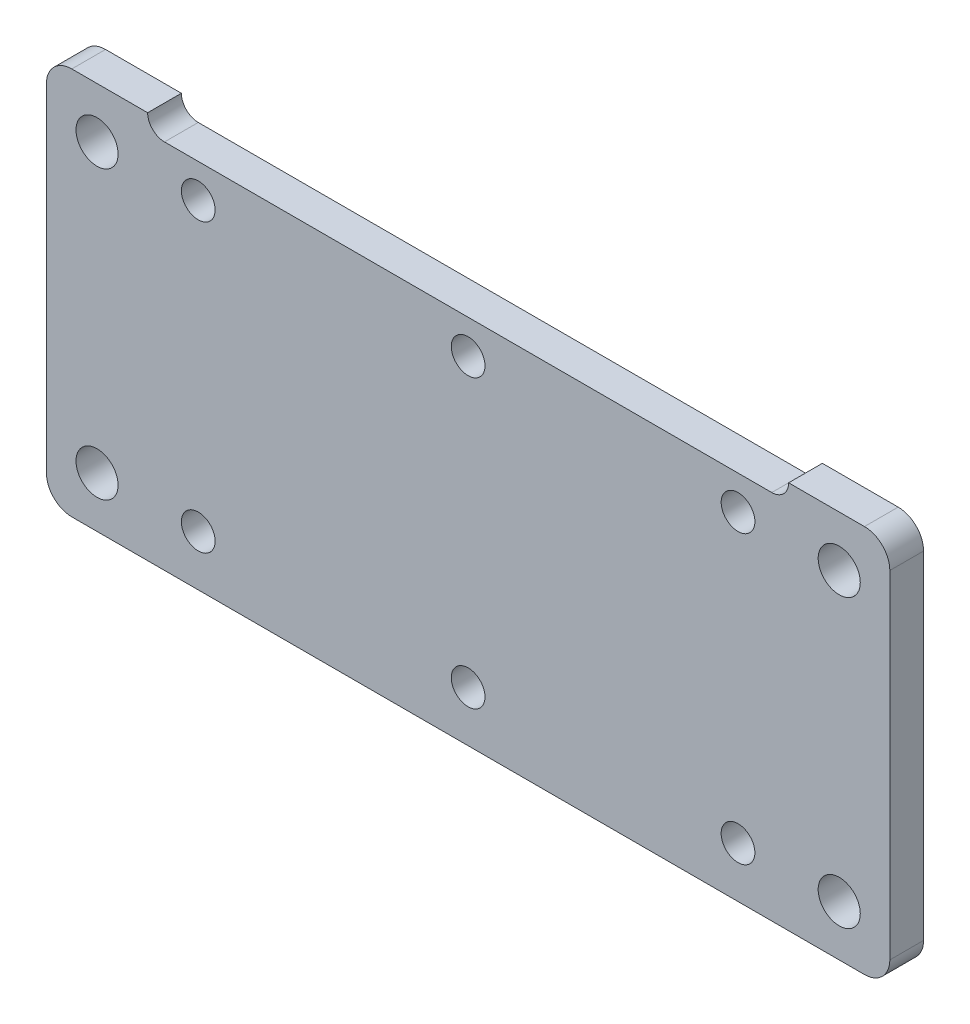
ISO-10303-21;
HEADER;
FILE_DESCRIPTION(('STEP AP214'),'2;1');
FILE_NAME('part.step','',(''),(''),'','','');
FILE_SCHEMA(('AUTOMOTIVE_DESIGN { 1 0 10303 214 1 1 1 1 }'));
ENDSEC;
DATA;
#1=APPLICATION_CONTEXT('core data for automotive mechanical design processes');
#2=APPLICATION_PROTOCOL_DEFINITION('international standard','automotive_design',2000,#1);
#3=PRODUCT_CONTEXT('',#1,'mechanical');
#4=PRODUCT('Part','Part','',(#3));
#5=PRODUCT_RELATED_PRODUCT_CATEGORY('part','',(#4));
#6=PRODUCT_DEFINITION_FORMATION('','',#4);
#7=PRODUCT_DEFINITION_CONTEXT('part definition',#1,'design');
#8=PRODUCT_DEFINITION('design','',#6,#7);
#9=PRODUCT_DEFINITION_SHAPE('','',#8);
#10=(LENGTH_UNIT() NAMED_UNIT(*) SI_UNIT(.MILLI.,.METRE.));
#11=(NAMED_UNIT(*) PLANE_ANGLE_UNIT() SI_UNIT($,.RADIAN.));
#12=(NAMED_UNIT(*) SI_UNIT($,.STERADIAN.) SOLID_ANGLE_UNIT());
#13=UNCERTAINTY_MEASURE_WITH_UNIT(LENGTH_MEASURE(1.E-05),#10,'distance_accuracy_value','');
#14=(GEOMETRIC_REPRESENTATION_CONTEXT(3) GLOBAL_UNCERTAINTY_ASSIGNED_CONTEXT((#13)) GLOBAL_UNIT_ASSIGNED_CONTEXT((#10,
#11,#12)) REPRESENTATION_CONTEXT('',''));
#15=CARTESIAN_POINT('',(0.,0.,0.));
#16=DIRECTION('',(0.,0.,1.));
#17=DIRECTION('',(1.,0.,0.));
#18=AXIS2_PLACEMENT_3D('',#15,#16,#17);
#19=CARTESIAN_POINT('',(0.,0.,6.35));
#20=DIRECTION('',(0.,0.,1.));
#21=DIRECTION('',(1.,0.,0.));
#22=AXIS2_PLACEMENT_3D('',#19,#20,#21);
#23=PLANE('',#22);
#24=CARTESIAN_POINT('',(0.,-26.9875,6.35));
#25=DIRECTION('',(0.,0.,1.));
#26=DIRECTION('',(1.,0.,0.));
#27=AXIS2_PLACEMENT_3D('',#24,#25,#26);
#28=CIRCLE('',#27,3.175);
#29=CARTESIAN_POINT('',(3.175,-26.9875,6.35));
#30=VERTEX_POINT('',#29);
#31=EDGE_CURVE('E280',#30,#30,#28,.T.);
#32=ORIENTED_EDGE('',*,*,#31,.F.);
#33=EDGE_LOOP('',(#32));
#34=FACE_BOUND('',#33,.T.);
#35=CARTESIAN_POINT('',(50.8,26.9875,6.35));
#36=DIRECTION('',(0.,0.,1.));
#37=DIRECTION('',(1.,0.,0.));
#38=AXIS2_PLACEMENT_3D('',#35,#36,#37);
#39=CIRCLE('',#38,3.175);
#40=CARTESIAN_POINT('',(53.975,26.9875,6.35));
#41=VERTEX_POINT('',#40);
#42=EDGE_CURVE('E268',#41,#41,#39,.T.);
#43=ORIENTED_EDGE('',*,*,#42,.F.);
#44=EDGE_LOOP('',(#43));
#45=FACE_BOUND('',#44,.T.);
#46=CARTESIAN_POINT('',(-50.8,26.9875,6.35));
#47=DIRECTION('',(0.,0.,1.));
#48=DIRECTION('',(1.,0.,0.));
#49=AXIS2_PLACEMENT_3D('',#46,#47,#48);
#50=CIRCLE('',#49,3.175);
#51=CARTESIAN_POINT('',(-47.625,26.9875,6.35));
#52=VERTEX_POINT('',#51);
#53=EDGE_CURVE('E256',#52,#52,#50,.T.);
#54=ORIENTED_EDGE('',*,*,#53,.F.);
#55=EDGE_LOOP('',(#54));
#56=FACE_BOUND('',#55,.T.);
#57=CARTESIAN_POINT('',(69.85,-26.9875,6.35));
#58=DIRECTION('',(0.,0.,1.));
#59=DIRECTION('',(1.,0.,0.));
#60=AXIS2_PLACEMENT_3D('',#57,#58,#59);
#61=CIRCLE('',#60,3.96240000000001);
#62=CARTESIAN_POINT('',(73.8124,-26.9875,6.35));
#63=VERTEX_POINT('',#62);
#64=EDGE_CURVE('E244',#63,#63,#61,.T.);
#65=ORIENTED_EDGE('',*,*,#64,.F.);
#66=EDGE_LOOP('',(#65));
#67=FACE_BOUND('',#66,.T.);
#68=CARTESIAN_POINT('',(-69.85,26.9875,6.35));
#69=DIRECTION('',(0.,0.,1.));
#70=DIRECTION('',(1.,0.,0.));
#71=AXIS2_PLACEMENT_3D('',#68,#69,#70);
#72=CIRCLE('',#71,3.96239999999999);
#73=CARTESIAN_POINT('',(-65.8876,26.9875,6.35));
#74=VERTEX_POINT('',#73);
#75=EDGE_CURVE('E228',#74,#74,#72,.T.);
#76=ORIENTED_EDGE('',*,*,#75,.F.);
#77=EDGE_LOOP('',(#76));
#78=FACE_BOUND('',#77,.T.);
#79=DIRECTION('',(0.,1.,0.));
#80=VECTOR('',#79,1.);
#81=CARTESIAN_POINT('',(79.375,-36.5125,6.35));
#82=LINE('',#81,#80);
#83=CARTESIAN_POINT('',(79.375,-31.7373,6.35));
#84=VERTEX_POINT('',#83);
#85=CARTESIAN_POINT('',(79.375,31.7373,6.35));
#86=VERTEX_POINT('',#85);
#87=EDGE_CURVE('E129',#84,#86,#82,.T.);
#88=ORIENTED_EDGE('',*,*,#87,.T.);
#89=CARTESIAN_POINT('',(74.5998,31.7373,6.35));
#90=DIRECTION('',(0.,0.,1.));
#91=DIRECTION('',(1.,0.,0.));
#92=AXIS2_PLACEMENT_3D('',#89,#90,#91);
#93=CIRCLE('',#92,4.7752);
#94=CARTESIAN_POINT('',(74.5998,36.5125,6.35));
#95=VERTEX_POINT('',#94);
#96=EDGE_CURVE('E124',#86,#95,#93,.T.);
#97=ORIENTED_EDGE('',*,*,#96,.T.);
#98=DIRECTION('',(-1.,0.,0.));
#99=VECTOR('',#98,1.);
#100=CARTESIAN_POINT('',(79.375,36.5125,6.35));
#101=LINE('',#100,#99);
#102=CARTESIAN_POINT('',(60.325,36.5125,6.35));
#103=VERTEX_POINT('',#102);
#104=EDGE_CURVE('E119',#95,#103,#101,.T.);
#105=ORIENTED_EDGE('',*,*,#104,.T.);
#106=CARTESIAN_POINT('',(57.15,36.5125,6.35));
#107=DIRECTION('',(0.,0.,1.));
#108=DIRECTION('',(1.,0.,0.));
#109=AXIS2_PLACEMENT_3D('',#106,#107,#108);
#110=CIRCLE('',#109,3.175);
#111=CARTESIAN_POINT('',(57.15,33.3375,6.35));
#112=VERTEX_POINT('',#111);
#113=EDGE_CURVE('E11',#103,#112,#110,.F.);
#114=ORIENTED_EDGE('',*,*,#113,.T.);
#115=DIRECTION('',(-1.,0.,0.));
#116=VECTOR('',#115,1.);
#117=CARTESIAN_POINT('',(-60.325,33.3375,6.35));
#118=LINE('',#117,#116);
#119=CARTESIAN_POINT('',(-57.15,33.3375,6.35));
#120=VERTEX_POINT('',#119);
#121=EDGE_CURVE('E128',#112,#120,#118,.T.);
#122=ORIENTED_EDGE('',*,*,#121,.T.);
#123=CARTESIAN_POINT('',(-57.15,36.5125,6.35));
#124=DIRECTION('',(0.,0.,1.));
#125=DIRECTION('',(1.,0.,0.));
#126=AXIS2_PLACEMENT_3D('',#123,#124,#125);
#127=CIRCLE('',#126,3.175);
#128=CARTESIAN_POINT('',(-60.325,36.5125,6.35));
#129=VERTEX_POINT('',#128);
#130=EDGE_CURVE('E154',#120,#129,#127,.F.);
#131=ORIENTED_EDGE('',*,*,#130,.T.);
#132=DIRECTION('',(-1.,0.,0.));
#133=VECTOR('',#132,1.);
#134=CARTESIAN_POINT('',(-60.325,36.5125,6.35));
#135=LINE('',#134,#133);
#136=CARTESIAN_POINT('',(-74.5998,36.5125,6.35));
#137=VERTEX_POINT('',#136);
#138=EDGE_CURVE('E170',#129,#137,#135,.T.);
#139=ORIENTED_EDGE('',*,*,#138,.T.);
#140=CARTESIAN_POINT('',(-74.5998,31.7373,6.35));
#141=DIRECTION('',(0.,0.,1.));
#142=DIRECTION('',(1.,0.,0.));
#143=AXIS2_PLACEMENT_3D('',#140,#141,#142);
#144=CIRCLE('',#143,4.7752);
#145=CARTESIAN_POINT('',(-79.375,31.7373,6.35));
#146=VERTEX_POINT('',#145);
#147=EDGE_CURVE('E186',#137,#146,#144,.T.);
#148=ORIENTED_EDGE('',*,*,#147,.T.);
#149=DIRECTION('',(0.,-1.,0.));
#150=VECTOR('',#149,1.);
#151=CARTESIAN_POINT('',(-79.375,36.5125,6.35));
#152=LINE('',#151,#150);
#153=CARTESIAN_POINT('',(-79.375,-31.7373,6.35));
#154=VERTEX_POINT('',#153);
#155=EDGE_CURVE('E163',#146,#154,#152,.T.);
#156=ORIENTED_EDGE('',*,*,#155,.T.);
#157=CARTESIAN_POINT('',(-74.5998,-31.7373,6.35));
#158=DIRECTION('',(0.,0.,1.));
#159=DIRECTION('',(1.,0.,0.));
#160=AXIS2_PLACEMENT_3D('',#157,#158,#159);
#161=CIRCLE('',#160,4.7752);
#162=CARTESIAN_POINT('',(-74.5998,-36.5125,6.35));
#163=VERTEX_POINT('',#162);
#164=EDGE_CURVE('E188',#154,#163,#161,.T.);
#165=ORIENTED_EDGE('',*,*,#164,.T.);
#166=DIRECTION('',(1.,0.,0.));
#167=VECTOR('',#166,1.);
#168=CARTESIAN_POINT('',(-79.375,-36.5125,6.35));
#169=LINE('',#168,#167);
#170=CARTESIAN_POINT('',(74.5997999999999,-36.5125,6.35));
#171=VERTEX_POINT('',#170);
#172=EDGE_CURVE('E215',#163,#171,#169,.T.);
#173=ORIENTED_EDGE('',*,*,#172,.T.);
#174=CARTESIAN_POINT('',(74.5998,-31.7373,6.35));
#175=DIRECTION('',(0.,0.,1.));
#176=DIRECTION('',(1.,0.,0.));
#177=AXIS2_PLACEMENT_3D('',#174,#175,#176);
#178=CIRCLE('',#177,4.7752);
#179=EDGE_CURVE('E190',#171,#84,#178,.T.);
#180=ORIENTED_EDGE('',*,*,#179,.T.);
#181=EDGE_LOOP('',(#88,#97,#105,#114,#122,#131,#139,#148,#156,#165,#173,#180));
#182=FACE_BOUND('',#181,.T.);
#183=CARTESIAN_POINT('',(-69.85,-26.9875,6.35));
#184=DIRECTION('',(0.,0.,1.));
#185=DIRECTION('',(1.,0.,0.));
#186=AXIS2_PLACEMENT_3D('',#183,#184,#185);
#187=CIRCLE('',#186,3.96239999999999);
#188=CARTESIAN_POINT('',(-65.8876,-26.9875,6.35));
#189=VERTEX_POINT('',#188);
#190=EDGE_CURVE('E238',#189,#189,#187,.T.);
#191=ORIENTED_EDGE('',*,*,#190,.F.);
#192=EDGE_LOOP('',(#191));
#193=FACE_BOUND('',#192,.T.);
#194=CARTESIAN_POINT('',(69.85,26.9875,6.35));
#195=DIRECTION('',(0.,0.,1.));
#196=DIRECTION('',(1.,0.,0.));
#197=AXIS2_PLACEMENT_3D('',#194,#195,#196);
#198=CIRCLE('',#197,3.96240000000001);
#199=CARTESIAN_POINT('',(73.8124,26.9875,6.35));
#200=VERTEX_POINT('',#199);
#201=EDGE_CURVE('E250',#200,#200,#198,.T.);
#202=ORIENTED_EDGE('',*,*,#201,.F.);
#203=EDGE_LOOP('',(#202));
#204=FACE_BOUND('',#203,.T.);
#205=CARTESIAN_POINT('',(0.,26.9875,6.35));
#206=DIRECTION('',(0.,0.,1.));
#207=DIRECTION('',(1.,0.,0.));
#208=AXIS2_PLACEMENT_3D('',#205,#206,#207);
#209=CIRCLE('',#208,3.175);
#210=CARTESIAN_POINT('',(3.175,26.9875,6.35));
#211=VERTEX_POINT('',#210);
#212=EDGE_CURVE('E262',#211,#211,#209,.T.);
#213=ORIENTED_EDGE('',*,*,#212,.F.);
#214=EDGE_LOOP('',(#213));
#215=FACE_BOUND('',#214,.T.);
#216=CARTESIAN_POINT('',(-50.8,-26.9875,6.35));
#217=DIRECTION('',(0.,0.,1.));
#218=DIRECTION('',(1.,0.,0.));
#219=AXIS2_PLACEMENT_3D('',#216,#217,#218);
#220=CIRCLE('',#219,3.175);
#221=CARTESIAN_POINT('',(-47.625,-26.9875,6.35));
#222=VERTEX_POINT('',#221);
#223=EDGE_CURVE('E274',#222,#222,#220,.T.);
#224=ORIENTED_EDGE('',*,*,#223,.F.);
#225=EDGE_LOOP('',(#224));
#226=FACE_BOUND('',#225,.T.);
#227=CARTESIAN_POINT('',(50.8,-26.9875,6.35));
#228=DIRECTION('',(0.,0.,1.));
#229=DIRECTION('',(1.,0.,0.));
#230=AXIS2_PLACEMENT_3D('',#227,#228,#229);
#231=CIRCLE('',#230,3.175);
#232=CARTESIAN_POINT('',(53.975,-26.9875,6.35));
#233=VERTEX_POINT('',#232);
#234=EDGE_CURVE('E286',#233,#233,#231,.T.);
#235=ORIENTED_EDGE('',*,*,#234,.F.);
#236=EDGE_LOOP('',(#235));
#237=FACE_BOUND('',#236,.T.);
#238=ADVANCED_FACE('F33',(#34,#45,#56,#67,#78,#182,#193,#204,#215,#226,#237),#23,.T.);
#239=CARTESIAN_POINT('',(0.,0.,0.));
#240=DIRECTION('',(0.,0.,1.));
#241=DIRECTION('',(1.,0.,0.));
#242=AXIS2_PLACEMENT_3D('',#239,#240,#241);
#243=PLANE('',#242);
#244=CARTESIAN_POINT('',(0.,-26.9875,0.));
#245=DIRECTION('',(0.,0.,1.));
#246=DIRECTION('',(1.,0.,0.));
#247=AXIS2_PLACEMENT_3D('',#244,#245,#246);
#248=CIRCLE('',#247,3.175);
#249=CARTESIAN_POINT('',(3.175,-26.9875,0.));
#250=VERTEX_POINT('',#249);
#251=EDGE_CURVE('E283',#250,#250,#248,.T.);
#252=ORIENTED_EDGE('',*,*,#251,.T.);
#253=EDGE_LOOP('',(#252));
#254=FACE_BOUND('',#253,.T.);
#255=CARTESIAN_POINT('',(50.8,26.9875,0.));
#256=DIRECTION('',(0.,0.,1.));
#257=DIRECTION('',(1.,0.,0.));
#258=AXIS2_PLACEMENT_3D('',#255,#256,#257);
#259=CIRCLE('',#258,3.175);
#260=CARTESIAN_POINT('',(53.975,26.9875,0.));
#261=VERTEX_POINT('',#260);
#262=EDGE_CURVE('E271',#261,#261,#259,.T.);
#263=ORIENTED_EDGE('',*,*,#262,.T.);
#264=EDGE_LOOP('',(#263));
#265=FACE_BOUND('',#264,.T.);
#266=CARTESIAN_POINT('',(-50.8,26.9875,0.));
#267=DIRECTION('',(0.,0.,1.));
#268=DIRECTION('',(1.,0.,0.));
#269=AXIS2_PLACEMENT_3D('',#266,#267,#268);
#270=CIRCLE('',#269,3.175);
#271=CARTESIAN_POINT('',(-47.625,26.9875,0.));
#272=VERTEX_POINT('',#271);
#273=EDGE_CURVE('E259',#272,#272,#270,.T.);
#274=ORIENTED_EDGE('',*,*,#273,.T.);
#275=EDGE_LOOP('',(#274));
#276=FACE_BOUND('',#275,.T.);
#277=CARTESIAN_POINT('',(69.85,-26.9875,0.));
#278=DIRECTION('',(0.,0.,1.));
#279=DIRECTION('',(1.,0.,0.));
#280=AXIS2_PLACEMENT_3D('',#277,#278,#279);
#281=CIRCLE('',#280,3.96240000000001);
#282=CARTESIAN_POINT('',(73.8124,-26.9875,0.));
#283=VERTEX_POINT('',#282);
#284=EDGE_CURVE('E247',#283,#283,#281,.T.);
#285=ORIENTED_EDGE('',*,*,#284,.T.);
#286=EDGE_LOOP('',(#285));
#287=FACE_BOUND('',#286,.T.);
#288=CARTESIAN_POINT('',(-69.85,26.9875,0.));
#289=DIRECTION('',(0.,0.,1.));
#290=DIRECTION('',(1.,0.,0.));
#291=AXIS2_PLACEMENT_3D('',#288,#289,#290);
#292=CIRCLE('',#291,3.96239999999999);
#293=CARTESIAN_POINT('',(-65.8876,26.9875,0.));
#294=VERTEX_POINT('',#293);
#295=EDGE_CURVE('E235',#294,#294,#292,.T.);
#296=ORIENTED_EDGE('',*,*,#295,.T.);
#297=EDGE_LOOP('',(#296));
#298=FACE_BOUND('',#297,.T.);
#299=DIRECTION('',(-1.,0.,0.));
#300=VECTOR('',#299,1.);
#301=CARTESIAN_POINT('',(79.375,36.5125,0.));
#302=LINE('',#301,#300);
#303=CARTESIAN_POINT('',(74.5998,36.5125,0.));
#304=VERTEX_POINT('',#303);
#305=CARTESIAN_POINT('',(60.325,36.5125,0.));
#306=VERTEX_POINT('',#305);
#307=EDGE_CURVE('E136',#304,#306,#302,.T.);
#308=ORIENTED_EDGE('',*,*,#307,.F.);
#309=CARTESIAN_POINT('',(74.5998,31.7373,0.));
#310=DIRECTION('',(0.,0.,1.));
#311=DIRECTION('',(1.,0.,0.));
#312=AXIS2_PLACEMENT_3D('',#309,#310,#311);
#313=CIRCLE('',#312,4.7752);
#314=CARTESIAN_POINT('',(79.375,31.7373,0.));
#315=VERTEX_POINT('',#314);
#316=EDGE_CURVE('E179',#304,#315,#313,.F.);
#317=ORIENTED_EDGE('',*,*,#316,.T.);
#318=DIRECTION('',(0.,1.,0.));
#319=VECTOR('',#318,1.);
#320=CARTESIAN_POINT('',(79.375,-36.5125,0.));
#321=LINE('',#320,#319);
#322=CARTESIAN_POINT('',(79.375,-31.7373,0.));
#323=VERTEX_POINT('',#322);
#324=EDGE_CURVE('E165',#323,#315,#321,.T.);
#325=ORIENTED_EDGE('',*,*,#324,.F.);
#326=CARTESIAN_POINT('',(74.5998,-31.7373,0.));
#327=DIRECTION('',(0.,0.,1.));
#328=DIRECTION('',(1.,0.,0.));
#329=AXIS2_PLACEMENT_3D('',#326,#327,#328);
#330=CIRCLE('',#329,4.7752);
#331=CARTESIAN_POINT('',(74.5997999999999,-36.5125,0.));
#332=VERTEX_POINT('',#331);
#333=EDGE_CURVE('E177',#323,#332,#330,.F.);
#334=ORIENTED_EDGE('',*,*,#333,.T.);
#335=DIRECTION('',(1.,0.,0.));
#336=VECTOR('',#335,1.);
#337=CARTESIAN_POINT('',(-79.375,-36.5125,0.));
#338=LINE('',#337,#336);
#339=CARTESIAN_POINT('',(-74.5998,-36.5125,0.));
#340=VERTEX_POINT('',#339);
#341=EDGE_CURVE('E223',#340,#332,#338,.T.);
#342=ORIENTED_EDGE('',*,*,#341,.F.);
#343=CARTESIAN_POINT('',(-74.5998,-31.7373,0.));
#344=DIRECTION('',(0.,0.,1.));
#345=DIRECTION('',(1.,0.,0.));
#346=AXIS2_PLACEMENT_3D('',#343,#344,#345);
#347=CIRCLE('',#346,4.7752);
#348=CARTESIAN_POINT('',(-79.375,-31.7373,0.));
#349=VERTEX_POINT('',#348);
#350=EDGE_CURVE('E175',#340,#349,#347,.F.);
#351=ORIENTED_EDGE('',*,*,#350,.T.);
#352=DIRECTION('',(0.,-1.,0.));
#353=VECTOR('',#352,1.);
#354=CARTESIAN_POINT('',(-79.375,36.5125,0.));
#355=LINE('',#354,#353);
#356=CARTESIAN_POINT('',(-79.375,31.7373,0.));
#357=VERTEX_POINT('',#356);
#358=EDGE_CURVE('E208',#357,#349,#355,.T.);
#359=ORIENTED_EDGE('',*,*,#358,.F.);
#360=CARTESIAN_POINT('',(-74.5998,31.7373,0.));
#361=DIRECTION('',(0.,0.,1.));
#362=DIRECTION('',(1.,0.,0.));
#363=AXIS2_PLACEMENT_3D('',#360,#361,#362);
#364=CIRCLE('',#363,4.7752);
#365=CARTESIAN_POINT('',(-74.5998,36.5125,0.));
#366=VERTEX_POINT('',#365);
#367=EDGE_CURVE('E173',#357,#366,#364,.F.);
#368=ORIENTED_EDGE('',*,*,#367,.T.);
#369=DIRECTION('',(-1.,0.,0.));
#370=VECTOR('',#369,1.);
#371=CARTESIAN_POINT('',(-60.325,36.5125,0.));
#372=LINE('',#371,#370);
#373=CARTESIAN_POINT('',(-60.325,36.5125,0.));
#374=VERTEX_POINT('',#373);
#375=EDGE_CURVE('E160',#374,#366,#372,.T.);
#376=ORIENTED_EDGE('',*,*,#375,.F.);
#377=CARTESIAN_POINT('',(-57.15,36.5125,0.));
#378=DIRECTION('',(0.,0.,1.));
#379=DIRECTION('',(1.,0.,0.));
#380=AXIS2_PLACEMENT_3D('',#377,#378,#379);
#381=CIRCLE('',#380,3.175);
#382=CARTESIAN_POINT('',(-57.15,33.3375,0.));
#383=VERTEX_POINT('',#382);
#384=EDGE_CURVE('E147',#374,#383,#381,.T.);
#385=ORIENTED_EDGE('',*,*,#384,.T.);
#386=DIRECTION('',(-1.,0.,0.));
#387=VECTOR('',#386,1.);
#388=CARTESIAN_POINT('',(-60.325,33.3375,0.));
#389=LINE('',#388,#387);
#390=CARTESIAN_POINT('',(57.15,33.3375,0.));
#391=VERTEX_POINT('',#390);
#392=EDGE_CURVE('E158',#391,#383,#389,.T.);
#393=ORIENTED_EDGE('',*,*,#392,.F.);
#394=CARTESIAN_POINT('',(57.15,36.5125,0.));
#395=DIRECTION('',(0.,0.,1.));
#396=DIRECTION('',(1.,0.,0.));
#397=AXIS2_PLACEMENT_3D('',#394,#395,#396);
#398=CIRCLE('',#397,3.175);
#399=EDGE_CURVE('E41',#391,#306,#398,.T.);
#400=ORIENTED_EDGE('',*,*,#399,.T.);
#401=EDGE_LOOP('',(#308,#317,#325,#334,#342,#351,#359,#368,#376,#385,#393,#400));
#402=FACE_BOUND('',#401,.T.);
#403=CARTESIAN_POINT('',(-69.85,-26.9875,0.));
#404=DIRECTION('',(0.,0.,1.));
#405=DIRECTION('',(1.,0.,0.));
#406=AXIS2_PLACEMENT_3D('',#403,#404,#405);
#407=CIRCLE('',#406,3.96239999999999);
#408=CARTESIAN_POINT('',(-65.8876,-26.9875,0.));
#409=VERTEX_POINT('',#408);
#410=EDGE_CURVE('E241',#409,#409,#407,.T.);
#411=ORIENTED_EDGE('',*,*,#410,.T.);
#412=EDGE_LOOP('',(#411));
#413=FACE_BOUND('',#412,.T.);
#414=CARTESIAN_POINT('',(69.85,26.9875,0.));
#415=DIRECTION('',(0.,0.,1.));
#416=DIRECTION('',(1.,0.,0.));
#417=AXIS2_PLACEMENT_3D('',#414,#415,#416);
#418=CIRCLE('',#417,3.96240000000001);
#419=CARTESIAN_POINT('',(73.8124,26.9875,0.));
#420=VERTEX_POINT('',#419);
#421=EDGE_CURVE('E253',#420,#420,#418,.T.);
#422=ORIENTED_EDGE('',*,*,#421,.T.);
#423=EDGE_LOOP('',(#422));
#424=FACE_BOUND('',#423,.T.);
#425=CARTESIAN_POINT('',(0.,26.9875,0.));
#426=DIRECTION('',(0.,0.,1.));
#427=DIRECTION('',(1.,0.,0.));
#428=AXIS2_PLACEMENT_3D('',#425,#426,#427);
#429=CIRCLE('',#428,3.175);
#430=CARTESIAN_POINT('',(3.175,26.9875,0.));
#431=VERTEX_POINT('',#430);
#432=EDGE_CURVE('E265',#431,#431,#429,.T.);
#433=ORIENTED_EDGE('',*,*,#432,.T.);
#434=EDGE_LOOP('',(#433));
#435=FACE_BOUND('',#434,.T.);
#436=CARTESIAN_POINT('',(-50.8,-26.9875,0.));
#437=DIRECTION('',(0.,0.,1.));
#438=DIRECTION('',(1.,0.,0.));
#439=AXIS2_PLACEMENT_3D('',#436,#437,#438);
#440=CIRCLE('',#439,3.175);
#441=CARTESIAN_POINT('',(-47.625,-26.9875,0.));
#442=VERTEX_POINT('',#441);
#443=EDGE_CURVE('E277',#442,#442,#440,.T.);
#444=ORIENTED_EDGE('',*,*,#443,.T.);
#445=EDGE_LOOP('',(#444));
#446=FACE_BOUND('',#445,.T.);
#447=CARTESIAN_POINT('',(50.8,-26.9875,0.));
#448=DIRECTION('',(0.,0.,1.));
#449=DIRECTION('',(1.,0.,0.));
#450=AXIS2_PLACEMENT_3D('',#447,#448,#449);
#451=CIRCLE('',#450,3.175);
#452=CARTESIAN_POINT('',(53.975,-26.9875,0.));
#453=VERTEX_POINT('',#452);
#454=EDGE_CURVE('E289',#453,#453,#451,.T.);
#455=ORIENTED_EDGE('',*,*,#454,.T.);
#456=EDGE_LOOP('',(#455));
#457=FACE_BOUND('',#456,.T.);
#458=ADVANCED_FACE('F156',(#254,#265,#276,#287,#298,#402,#413,#424,#435,#446,#457),#243,.F.);
#459=CARTESIAN_POINT('',(-79.375,36.5125,6.35));
#460=DIRECTION('',(1.,0.,0.));
#461=DIRECTION('',(0.,0.,-1.));
#462=AXIS2_PLACEMENT_3D('',#459,#460,#461);
#463=PLANE('',#462);
#464=ORIENTED_EDGE('',*,*,#358,.T.);
#465=DIRECTION('',(0.,0.,-1.));
#466=VECTOR('',#465,1.);
#467=CARTESIAN_POINT('',(-79.375,-31.7373,6.35));
#468=LINE('',#467,#466);
#469=EDGE_CURVE('E149',#349,#154,#468,.F.);
#470=ORIENTED_EDGE('',*,*,#469,.T.);
#471=ORIENTED_EDGE('',*,*,#155,.F.);
#472=DIRECTION('',(0.,0.,-1.));
#473=VECTOR('',#472,1.);
#474=CARTESIAN_POINT('',(-79.375,31.7373,6.35));
#475=LINE('',#474,#473);
#476=EDGE_CURVE('E198',#146,#357,#475,.T.);
#477=ORIENTED_EDGE('',*,*,#476,.T.);
#478=EDGE_LOOP('',(#464,#470,#471,#477));
#479=FACE_BOUND('',#478,.T.);
#480=ADVANCED_FACE('F205',(#479),#463,.F.);
#481=CARTESIAN_POINT('',(-79.375,-36.5125,6.35));
#482=DIRECTION('',(0.,1.,0.));
#483=DIRECTION('',(0.,0.,1.));
#484=AXIS2_PLACEMENT_3D('',#481,#482,#483);
#485=PLANE('',#484);
#486=ORIENTED_EDGE('',*,*,#341,.T.);
#487=DIRECTION('',(0.,0.,-1.));
#488=VECTOR('',#487,1.);
#489=CARTESIAN_POINT('',(74.5998,-36.5125,6.35));
#490=LINE('',#489,#488);
#491=EDGE_CURVE('E196',#332,#171,#490,.F.);
#492=ORIENTED_EDGE('',*,*,#491,.T.);
#493=ORIENTED_EDGE('',*,*,#172,.F.);
#494=DIRECTION('',(0.,0.,-1.));
#495=VECTOR('',#494,1.);
#496=CARTESIAN_POINT('',(-74.5998,-36.5125,6.35));
#497=LINE('',#496,#495);
#498=EDGE_CURVE('E193',#163,#340,#497,.T.);
#499=ORIENTED_EDGE('',*,*,#498,.T.);
#500=EDGE_LOOP('',(#486,#492,#493,#499));
#501=FACE_BOUND('',#500,.T.);
#502=ADVANCED_FACE('F222',(#501),#485,.F.);
#503=CARTESIAN_POINT('',(79.375,-36.5125,6.35));
#504=DIRECTION('',(-1.,0.,0.));
#505=DIRECTION('',(0.,0.,1.));
#506=AXIS2_PLACEMENT_3D('',#503,#504,#505);
#507=PLANE('',#506);
#508=ORIENTED_EDGE('',*,*,#324,.T.);
#509=DIRECTION('',(0.,0.,-1.));
#510=VECTOR('',#509,1.);
#511=CARTESIAN_POINT('',(79.375,31.7373,6.35));
#512=LINE('',#511,#510);
#513=EDGE_CURVE('E184',#315,#86,#512,.F.);
#514=ORIENTED_EDGE('',*,*,#513,.T.);
#515=ORIENTED_EDGE('',*,*,#87,.F.);
#516=DIRECTION('',(0.,0.,-1.));
#517=VECTOR('',#516,1.);
#518=CARTESIAN_POINT('',(79.375,-31.7373,6.35));
#519=LINE('',#518,#517);
#520=EDGE_CURVE('E181',#84,#323,#519,.T.);
#521=ORIENTED_EDGE('',*,*,#520,.T.);
#522=EDGE_LOOP('',(#508,#514,#515,#521));
#523=FACE_BOUND('',#522,.T.);
#524=ADVANCED_FACE('F322',(#523),#507,.F.);
#525=CARTESIAN_POINT('',(79.375,36.5125,6.35));
#526=DIRECTION('',(0.,-1.,0.));
#527=DIRECTION('',(0.,0.,-1.));
#528=AXIS2_PLACEMENT_3D('',#525,#526,#527);
#529=PLANE('',#528);
#530=ORIENTED_EDGE('',*,*,#104,.F.);
#531=DIRECTION('',(0.,0.,-1.));
#532=VECTOR('',#531,1.);
#533=CARTESIAN_POINT('',(74.5998,36.5125,6.35));
#534=LINE('',#533,#532);
#535=EDGE_CURVE('E138',#95,#304,#534,.T.);
#536=ORIENTED_EDGE('',*,*,#535,.T.);
#537=ORIENTED_EDGE('',*,*,#307,.T.);
#538=DIRECTION('',(0.,0.,-1.));
#539=VECTOR('',#538,1.);
#540=CARTESIAN_POINT('',(60.325,36.5125,6.35));
#541=LINE('',#540,#539);
#542=EDGE_CURVE('E133',#103,#306,#541,.T.);
#543=ORIENTED_EDGE('',*,*,#542,.F.);
#544=EDGE_LOOP('',(#530,#536,#537,#543));
#545=FACE_BOUND('',#544,.T.);
#546=ADVANCED_FACE('F134',(#545),#529,.F.);
#547=CARTESIAN_POINT('',(-60.325,33.3375,6.35));
#548=DIRECTION('',(0.,-1.,0.));
#549=DIRECTION('',(0.,0.,-1.));
#550=AXIS2_PLACEMENT_3D('',#547,#548,#549);
#551=PLANE('',#550);
#552=ORIENTED_EDGE('',*,*,#392,.T.);
#553=DIRECTION('',(0.,0.,-1.));
#554=VECTOR('',#553,1.);
#555=CARTESIAN_POINT('',(-57.15,33.3375,6.35));
#556=LINE('',#555,#554);
#557=EDGE_CURVE('E48',#383,#120,#556,.F.);
#558=ORIENTED_EDGE('',*,*,#557,.T.);
#559=ORIENTED_EDGE('',*,*,#121,.F.);
#560=DIRECTION('',(0.,0.,-1.));
#561=VECTOR('',#560,1.);
#562=CARTESIAN_POINT('',(57.15,33.3375,0.));
#563=LINE('',#562,#561);
#564=EDGE_CURVE('E143',#112,#391,#563,.T.);
#565=ORIENTED_EDGE('',*,*,#564,.T.);
#566=EDGE_LOOP('',(#552,#558,#559,#565));
#567=FACE_BOUND('',#566,.T.);
#568=ADVANCED_FACE('F316',(#567),#551,.F.);
#569=CARTESIAN_POINT('',(-60.325,36.5125,6.35));
#570=DIRECTION('',(0.,-1.,0.));
#571=DIRECTION('',(0.,0.,-1.));
#572=AXIS2_PLACEMENT_3D('',#569,#570,#571);
#573=PLANE('',#572);
#574=ORIENTED_EDGE('',*,*,#375,.T.);
#575=DIRECTION('',(0.,0.,-1.));
#576=VECTOR('',#575,1.);
#577=CARTESIAN_POINT('',(-74.5998,36.5125,6.35));
#578=LINE('',#577,#576);
#579=EDGE_CURVE('E145',#366,#137,#578,.F.);
#580=ORIENTED_EDGE('',*,*,#579,.T.);
#581=ORIENTED_EDGE('',*,*,#138,.F.);
#582=DIRECTION('',(0.,0.,-1.));
#583=VECTOR('',#582,1.);
#584=CARTESIAN_POINT('',(-60.325,36.5125,6.35));
#585=LINE('',#584,#583);
#586=EDGE_CURVE('E139',#129,#374,#585,.T.);
#587=ORIENTED_EDGE('',*,*,#586,.T.);
#588=EDGE_LOOP('',(#574,#580,#581,#587));
#589=FACE_BOUND('',#588,.T.);
#590=ADVANCED_FACE('F313',(#589),#573,.F.);
#591=CARTESIAN_POINT('',(-69.85,26.9875,6.35));
#592=DIRECTION('',(0.,0.,-1.));
#593=DIRECTION('',(-1.,0.,0.));
#594=AXIS2_PLACEMENT_3D('',#591,#592,#593);
#595=CYLINDRICAL_SURFACE('',#594,3.96239999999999);
#596=ORIENTED_EDGE('',*,*,#75,.T.);
#597=EDGE_LOOP('',(#596));
#598=FACE_BOUND('',#597,.T.);
#599=ORIENTED_EDGE('',*,*,#295,.F.);
#600=EDGE_LOOP('',(#599));
#601=FACE_BOUND('',#600,.T.);
#602=ADVANCED_FACE('F310',(#598,#601),#595,.F.);
#603=CARTESIAN_POINT('',(-69.85,-26.9875,6.35));
#604=DIRECTION('',(0.,0.,-1.));
#605=DIRECTION('',(-1.,0.,0.));
#606=AXIS2_PLACEMENT_3D('',#603,#604,#605);
#607=CYLINDRICAL_SURFACE('',#606,3.96239999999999);
#608=ORIENTED_EDGE('',*,*,#190,.T.);
#609=EDGE_LOOP('',(#608));
#610=FACE_BOUND('',#609,.T.);
#611=ORIENTED_EDGE('',*,*,#410,.F.);
#612=EDGE_LOOP('',(#611));
#613=FACE_BOUND('',#612,.T.);
#614=ADVANCED_FACE('F484',(#610,#613),#607,.F.);
#615=CARTESIAN_POINT('',(69.85,-26.9875,6.35));
#616=DIRECTION('',(0.,0.,-1.));
#617=DIRECTION('',(-1.,0.,0.));
#618=AXIS2_PLACEMENT_3D('',#615,#616,#617);
#619=CYLINDRICAL_SURFACE('',#618,3.96240000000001);
#620=ORIENTED_EDGE('',*,*,#64,.T.);
#621=EDGE_LOOP('',(#620));
#622=FACE_BOUND('',#621,.T.);
#623=ORIENTED_EDGE('',*,*,#284,.F.);
#624=EDGE_LOOP('',(#623));
#625=FACE_BOUND('',#624,.T.);
#626=ADVANCED_FACE('F476',(#622,#625),#619,.F.);
#627=CARTESIAN_POINT('',(69.85,26.9875,6.35));
#628=DIRECTION('',(0.,0.,-1.));
#629=DIRECTION('',(-1.,0.,0.));
#630=AXIS2_PLACEMENT_3D('',#627,#628,#629);
#631=CYLINDRICAL_SURFACE('',#630,3.96240000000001);
#632=ORIENTED_EDGE('',*,*,#201,.T.);
#633=EDGE_LOOP('',(#632));
#634=FACE_BOUND('',#633,.T.);
#635=ORIENTED_EDGE('',*,*,#421,.F.);
#636=EDGE_LOOP('',(#635));
#637=FACE_BOUND('',#636,.T.);
#638=ADVANCED_FACE('F468',(#634,#637),#631,.F.);
#639=CARTESIAN_POINT('',(-50.8,26.9875,6.35));
#640=DIRECTION('',(0.,0.,-1.));
#641=DIRECTION('',(-1.,0.,0.));
#642=AXIS2_PLACEMENT_3D('',#639,#640,#641);
#643=CYLINDRICAL_SURFACE('',#642,3.175);
#644=ORIENTED_EDGE('',*,*,#53,.T.);
#645=EDGE_LOOP('',(#644));
#646=FACE_BOUND('',#645,.T.);
#647=ORIENTED_EDGE('',*,*,#273,.F.);
#648=EDGE_LOOP('',(#647));
#649=FACE_BOUND('',#648,.T.);
#650=ADVANCED_FACE('F460',(#646,#649),#643,.F.);
#651=CARTESIAN_POINT('',(0.,26.9875,6.35));
#652=DIRECTION('',(0.,0.,-1.));
#653=DIRECTION('',(-1.,0.,0.));
#654=AXIS2_PLACEMENT_3D('',#651,#652,#653);
#655=CYLINDRICAL_SURFACE('',#654,3.175);
#656=ORIENTED_EDGE('',*,*,#212,.T.);
#657=EDGE_LOOP('',(#656));
#658=FACE_BOUND('',#657,.T.);
#659=ORIENTED_EDGE('',*,*,#432,.F.);
#660=EDGE_LOOP('',(#659));
#661=FACE_BOUND('',#660,.T.);
#662=ADVANCED_FACE('F452',(#658,#661),#655,.F.);
#663=CARTESIAN_POINT('',(50.8,26.9875,6.35));
#664=DIRECTION('',(0.,0.,-1.));
#665=DIRECTION('',(-1.,0.,0.));
#666=AXIS2_PLACEMENT_3D('',#663,#664,#665);
#667=CYLINDRICAL_SURFACE('',#666,3.175);
#668=ORIENTED_EDGE('',*,*,#42,.T.);
#669=EDGE_LOOP('',(#668));
#670=FACE_BOUND('',#669,.T.);
#671=ORIENTED_EDGE('',*,*,#262,.F.);
#672=EDGE_LOOP('',(#671));
#673=FACE_BOUND('',#672,.T.);
#674=ADVANCED_FACE('F444',(#670,#673),#667,.F.);
#675=CARTESIAN_POINT('',(-50.8,-26.9875,6.35));
#676=DIRECTION('',(0.,0.,-1.));
#677=DIRECTION('',(-1.,0.,0.));
#678=AXIS2_PLACEMENT_3D('',#675,#676,#677);
#679=CYLINDRICAL_SURFACE('',#678,3.175);
#680=ORIENTED_EDGE('',*,*,#223,.T.);
#681=EDGE_LOOP('',(#680));
#682=FACE_BOUND('',#681,.T.);
#683=ORIENTED_EDGE('',*,*,#443,.F.);
#684=EDGE_LOOP('',(#683));
#685=FACE_BOUND('',#684,.T.);
#686=ADVANCED_FACE('F436',(#682,#685),#679,.F.);
#687=CARTESIAN_POINT('',(0.,-26.9875,6.35));
#688=DIRECTION('',(0.,0.,-1.));
#689=DIRECTION('',(-1.,0.,0.));
#690=AXIS2_PLACEMENT_3D('',#687,#688,#689);
#691=CYLINDRICAL_SURFACE('',#690,3.175);
#692=ORIENTED_EDGE('',*,*,#31,.T.);
#693=EDGE_LOOP('',(#692));
#694=FACE_BOUND('',#693,.T.);
#695=ORIENTED_EDGE('',*,*,#251,.F.);
#696=EDGE_LOOP('',(#695));
#697=FACE_BOUND('',#696,.T.);
#698=ADVANCED_FACE('F430',(#694,#697),#691,.F.);
#699=CARTESIAN_POINT('',(50.8,-26.9875,6.35));
#700=DIRECTION('',(0.,0.,-1.));
#701=DIRECTION('',(-1.,0.,0.));
#702=AXIS2_PLACEMENT_3D('',#699,#700,#701);
#703=CYLINDRICAL_SURFACE('',#702,3.175);
#704=ORIENTED_EDGE('',*,*,#234,.T.);
#705=EDGE_LOOP('',(#704));
#706=FACE_BOUND('',#705,.T.);
#707=ORIENTED_EDGE('',*,*,#454,.F.);
#708=EDGE_LOOP('',(#707));
#709=FACE_BOUND('',#708,.T.);
#710=ADVANCED_FACE('F295',(#706,#709),#703,.F.);
#711=CARTESIAN_POINT('',(74.5998,31.7373,6.35));
#712=DIRECTION('',(0.,0.,-1.));
#713=DIRECTION('',(-1.,0.,0.));
#714=AXIS2_PLACEMENT_3D('',#711,#712,#713);
#715=CYLINDRICAL_SURFACE('',#714,4.7752);
#716=ORIENTED_EDGE('',*,*,#96,.F.);
#717=ORIENTED_EDGE('',*,*,#513,.F.);
#718=ORIENTED_EDGE('',*,*,#316,.F.);
#719=ORIENTED_EDGE('',*,*,#535,.F.);
#720=EDGE_LOOP('',(#716,#717,#718,#719));
#721=FACE_BOUND('',#720,.T.);
#722=ADVANCED_FACE('F330',(#721),#715,.T.);
#723=CARTESIAN_POINT('',(74.5998,-31.7373,6.35));
#724=DIRECTION('',(0.,0.,-1.));
#725=DIRECTION('',(-1.,0.,0.));
#726=AXIS2_PLACEMENT_3D('',#723,#724,#725);
#727=CYLINDRICAL_SURFACE('',#726,4.7752);
#728=ORIENTED_EDGE('',*,*,#179,.F.);
#729=ORIENTED_EDGE('',*,*,#491,.F.);
#730=ORIENTED_EDGE('',*,*,#333,.F.);
#731=ORIENTED_EDGE('',*,*,#520,.F.);
#732=EDGE_LOOP('',(#728,#729,#730,#731));
#733=FACE_BOUND('',#732,.T.);
#734=ADVANCED_FACE('F333',(#733),#727,.T.);
#735=CARTESIAN_POINT('',(-74.5998,-31.7373,6.35));
#736=DIRECTION('',(0.,0.,-1.));
#737=DIRECTION('',(-1.,0.,0.));
#738=AXIS2_PLACEMENT_3D('',#735,#736,#737);
#739=CYLINDRICAL_SURFACE('',#738,4.7752);
#740=ORIENTED_EDGE('',*,*,#164,.F.);
#741=ORIENTED_EDGE('',*,*,#469,.F.);
#742=ORIENTED_EDGE('',*,*,#350,.F.);
#743=ORIENTED_EDGE('',*,*,#498,.F.);
#744=EDGE_LOOP('',(#740,#741,#742,#743));
#745=FACE_BOUND('',#744,.T.);
#746=ADVANCED_FACE('F218',(#745),#739,.T.);
#747=CARTESIAN_POINT('',(-74.5998,31.7373,6.35));
#748=DIRECTION('',(0.,0.,-1.));
#749=DIRECTION('',(-1.,0.,0.));
#750=AXIS2_PLACEMENT_3D('',#747,#748,#749);
#751=CYLINDRICAL_SURFACE('',#750,4.7752);
#752=ORIENTED_EDGE('',*,*,#147,.F.);
#753=ORIENTED_EDGE('',*,*,#579,.F.);
#754=ORIENTED_EDGE('',*,*,#367,.F.);
#755=ORIENTED_EDGE('',*,*,#476,.F.);
#756=EDGE_LOOP('',(#752,#753,#754,#755));
#757=FACE_BOUND('',#756,.T.);
#758=ADVANCED_FACE('F340',(#757),#751,.T.);
#759=CARTESIAN_POINT('',(-57.15,36.5125,6.35));
#760=DIRECTION('',(0.,0.,1.));
#761=DIRECTION('',(1.,0.,0.));
#762=AXIS2_PLACEMENT_3D('',#759,#760,#761);
#763=CYLINDRICAL_SURFACE('',#762,3.175);
#764=ORIENTED_EDGE('',*,*,#130,.F.);
#765=ORIENTED_EDGE('',*,*,#557,.F.);
#766=ORIENTED_EDGE('',*,*,#384,.F.);
#767=ORIENTED_EDGE('',*,*,#586,.F.);
#768=EDGE_LOOP('',(#764,#765,#766,#767));
#769=FACE_BOUND('',#768,.T.);
#770=ADVANCED_FACE('F342',(#769),#763,.F.);
#771=CARTESIAN_POINT('',(57.15,36.5125,6.35));
#772=DIRECTION('',(0.,0.,1.));
#773=DIRECTION('',(1.,0.,0.));
#774=AXIS2_PLACEMENT_3D('',#771,#772,#773);
#775=CYLINDRICAL_SURFACE('',#774,3.175);
#776=ORIENTED_EDGE('',*,*,#113,.F.);
#777=ORIENTED_EDGE('',*,*,#542,.T.);
#778=ORIENTED_EDGE('',*,*,#399,.F.);
#779=ORIENTED_EDGE('',*,*,#564,.F.);
#780=EDGE_LOOP('',(#776,#777,#778,#779));
#781=FACE_BOUND('',#780,.T.);
#782=ADVANCED_FACE('F35',(#781),#775,.F.);
#783=CLOSED_SHELL('',(#238,#458,#480,#502,#524,#546,#568,#590,#602,#614,#626,#638,#650,#662,
#674,#686,#698,#710,#722,#734,#746,#758,#770,#782));
#784=MANIFOLD_SOLID_BREP('B2',#783);
#785=ADVANCED_BREP_SHAPE_REPRESENTATION('',(#18,#784),#14);
#786=SHAPE_DEFINITION_REPRESENTATION(#9,#785);
ENDSEC;
END-ISO-10303-21;
